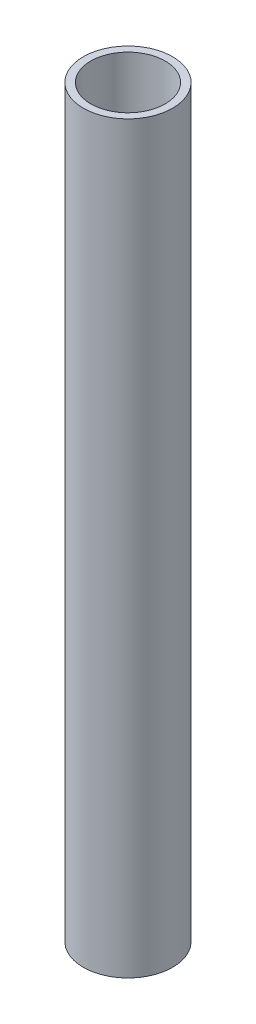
ISO-10303-21;
HEADER;
FILE_DESCRIPTION(('STEP AP214'),'2;1');
FILE_NAME('part.step','',(''),(''),'','','');
FILE_SCHEMA(('AUTOMOTIVE_DESIGN { 1 0 10303 214 1 1 1 1 }'));
ENDSEC;
DATA;
#1=APPLICATION_CONTEXT('core data for automotive mechanical design processes');
#2=APPLICATION_PROTOCOL_DEFINITION('international standard','automotive_design',2000,#1);
#3=PRODUCT_CONTEXT('',#1,'mechanical');
#4=PRODUCT('Part','Part','',(#3));
#5=PRODUCT_RELATED_PRODUCT_CATEGORY('part','',(#4));
#6=PRODUCT_DEFINITION_FORMATION('','',#4);
#7=PRODUCT_DEFINITION_CONTEXT('part definition',#1,'design');
#8=PRODUCT_DEFINITION('design','',#6,#7);
#9=PRODUCT_DEFINITION_SHAPE('','',#8);
#10=(LENGTH_UNIT() NAMED_UNIT(*) SI_UNIT(.MILLI.,.METRE.));
#11=(NAMED_UNIT(*) PLANE_ANGLE_UNIT() SI_UNIT($,.RADIAN.));
#12=(NAMED_UNIT(*) SI_UNIT($,.STERADIAN.) SOLID_ANGLE_UNIT());
#13=UNCERTAINTY_MEASURE_WITH_UNIT(LENGTH_MEASURE(1.E-05),#10,'distance_accuracy_value','');
#14=(GEOMETRIC_REPRESENTATION_CONTEXT(3) GLOBAL_UNCERTAINTY_ASSIGNED_CONTEXT((#13)) GLOBAL_UNIT_ASSIGNED_CONTEXT((#10,
#11,#12)) REPRESENTATION_CONTEXT('',''));
#15=CARTESIAN_POINT('',(0.,0.,0.));
#16=DIRECTION('',(0.,0.,1.));
#17=DIRECTION('',(1.,0.,0.));
#18=AXIS2_PLACEMENT_3D('',#15,#16,#17);
#19=CARTESIAN_POINT('',(0.,50.,0.));
#20=DIRECTION('',(0.,1.,0.));
#21=DIRECTION('',(0.,0.,1.));
#22=AXIS2_PLACEMENT_3D('',#19,#20,#21);
#23=PLANE('',#22);
#24=CARTESIAN_POINT('',(0.,50.,0.));
#25=DIRECTION('',(0.,1.,0.));
#26=DIRECTION('',(0.,0.,1.));
#27=AXIS2_PLACEMENT_3D('',#24,#25,#26);
#28=CIRCLE('',#27,6.);
#29=CARTESIAN_POINT('',(0.,50.,6.));
#30=VERTEX_POINT('',#29);
#31=EDGE_CURVE('E10',#30,#30,#28,.T.);
#32=ORIENTED_EDGE('',*,*,#31,.T.);
#33=EDGE_LOOP('',(#32));
#34=FACE_BOUND('',#33,.T.);
#35=CARTESIAN_POINT('',(0.,50.,0.));
#36=DIRECTION('',(0.,1.,0.));
#37=DIRECTION('',(0.,0.,1.));
#38=AXIS2_PLACEMENT_3D('',#35,#36,#37);
#39=CIRCLE('',#38,5.);
#40=CARTESIAN_POINT('',(0.,50.,4.99999999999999));
#41=VERTEX_POINT('',#40);
#42=EDGE_CURVE('E48',#41,#41,#39,.T.);
#43=ORIENTED_EDGE('',*,*,#42,.F.);
#44=EDGE_LOOP('',(#43));
#45=FACE_BOUND('',#44,.T.);
#46=ADVANCED_FACE('F34',(#34,#45),#23,.T.);
#47=CARTESIAN_POINT('',(0.,-50.0000000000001,1.11022302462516E-13));
#48=DIRECTION('',(0.,1.,0.));
#49=DIRECTION('',(0.,0.,1.));
#50=AXIS2_PLACEMENT_3D('',#47,#48,#49);
#51=PLANE('',#50);
#52=CARTESIAN_POINT('',(0.,-50.0000000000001,1.11022302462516E-13));
#53=DIRECTION('',(0.,1.,0.));
#54=DIRECTION('',(0.,0.,1.));
#55=AXIS2_PLACEMENT_3D('',#52,#53,#54);
#56=CIRCLE('',#55,6.);
#57=CARTESIAN_POINT('',(0.,-50.0000000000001,6.00000000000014));
#58=VERTEX_POINT('',#57);
#59=EDGE_CURVE('E42',#58,#58,#56,.T.);
#60=ORIENTED_EDGE('',*,*,#59,.F.);
#61=EDGE_LOOP('',(#60));
#62=FACE_BOUND('',#61,.T.);
#63=CARTESIAN_POINT('',(0.,-50.0000000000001,1.11022302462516E-13));
#64=DIRECTION('',(0.,1.,0.));
#65=DIRECTION('',(0.,0.,1.));
#66=AXIS2_PLACEMENT_3D('',#63,#64,#65);
#67=CIRCLE('',#66,5.);
#68=CARTESIAN_POINT('',(0.,-50.0000000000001,5.00000000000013));
#69=VERTEX_POINT('',#68);
#70=EDGE_CURVE('E53',#69,#69,#67,.T.);
#71=ORIENTED_EDGE('',*,*,#70,.T.);
#72=EDGE_LOOP('',(#71));
#73=FACE_BOUND('',#72,.T.);
#74=ADVANCED_FACE('F59',(#62,#73),#51,.F.);
#75=CARTESIAN_POINT('',(0.,50.,0.));
#76=DIRECTION('',(0.,-1.,0.));
#77=DIRECTION('',(0.,0.,-1.));
#78=AXIS2_PLACEMENT_3D('',#75,#76,#77);
#79=CYLINDRICAL_SURFACE('',#78,6.);
#80=ORIENTED_EDGE('',*,*,#31,.F.);
#81=EDGE_LOOP('',(#80));
#82=FACE_BOUND('',#81,.T.);
#83=ORIENTED_EDGE('',*,*,#59,.T.);
#84=EDGE_LOOP('',(#83));
#85=FACE_BOUND('',#84,.T.);
#86=ADVANCED_FACE('F36',(#82,#85),#79,.T.);
#87=CARTESIAN_POINT('',(0.,50.,0.));
#88=DIRECTION('',(0.,-1.,0.));
#89=DIRECTION('',(0.,0.,-1.));
#90=AXIS2_PLACEMENT_3D('',#87,#88,#89);
#91=CYLINDRICAL_SURFACE('',#90,5.);
#92=ORIENTED_EDGE('',*,*,#42,.T.);
#93=EDGE_LOOP('',(#92));
#94=FACE_BOUND('',#93,.T.);
#95=ORIENTED_EDGE('',*,*,#70,.F.);
#96=EDGE_LOOP('',(#95));
#97=FACE_BOUND('',#96,.T.);
#98=ADVANCED_FACE('F61',(#94,#97),#91,.F.);
#99=CLOSED_SHELL('',(#46,#74,#86,#98));
#100=MANIFOLD_SOLID_BREP('B2',#99);
#101=ADVANCED_BREP_SHAPE_REPRESENTATION('',(#18,#100),#14);
#102=SHAPE_DEFINITION_REPRESENTATION(#9,#101);
ENDSEC;
END-ISO-10303-21;
